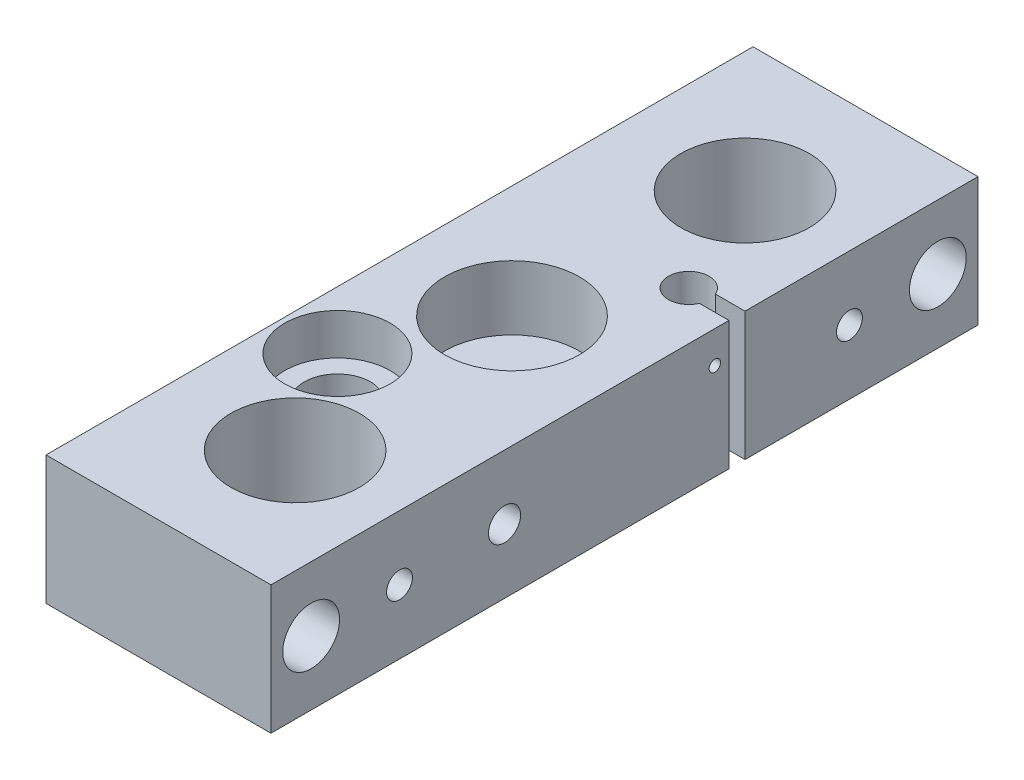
ISO-10303-21;
HEADER;
FILE_DESCRIPTION(('STEP AP214'),'2;1');
FILE_NAME('part.step','',(''),(''),'','','');
FILE_SCHEMA(('AUTOMOTIVE_DESIGN { 1 0 10303 214 1 1 1 1 }'));
ENDSEC;
DATA;
#1=APPLICATION_CONTEXT('core data for automotive mechanical design processes');
#2=APPLICATION_PROTOCOL_DEFINITION('international standard','automotive_design',2000,#1);
#3=PRODUCT_CONTEXT('',#1,'mechanical');
#4=PRODUCT('Part','Part','',(#3));
#5=PRODUCT_RELATED_PRODUCT_CATEGORY('part','',(#4));
#6=PRODUCT_DEFINITION_FORMATION('','',#4);
#7=PRODUCT_DEFINITION_CONTEXT('part definition',#1,'design');
#8=PRODUCT_DEFINITION('design','',#6,#7);
#9=PRODUCT_DEFINITION_SHAPE('','',#8);
#10=(LENGTH_UNIT() NAMED_UNIT(*) SI_UNIT(.MILLI.,.METRE.));
#11=(NAMED_UNIT(*) PLANE_ANGLE_UNIT() SI_UNIT($,.RADIAN.));
#12=(NAMED_UNIT(*) SI_UNIT($,.STERADIAN.) SOLID_ANGLE_UNIT());
#13=UNCERTAINTY_MEASURE_WITH_UNIT(LENGTH_MEASURE(1.E-05),#10,'distance_accuracy_value','');
#14=(GEOMETRIC_REPRESENTATION_CONTEXT(3) GLOBAL_UNCERTAINTY_ASSIGNED_CONTEXT((#13)) GLOBAL_UNIT_ASSIGNED_CONTEXT((#10,
#11,#12)) REPRESENTATION_CONTEXT('',''));
#15=CARTESIAN_POINT('',(0.,0.,0.));
#16=DIRECTION('',(0.,0.,1.));
#17=DIRECTION('',(1.,0.,0.));
#18=AXIS2_PLACEMENT_3D('',#15,#16,#17);
#19=CARTESIAN_POINT('',(22.225,12.7,-69.85));
#20=DIRECTION('',(-1.,0.,0.));
#21=DIRECTION('',(0.,0.,1.));
#22=AXIS2_PLACEMENT_3D('',#19,#20,#21);
#23=PLANE('',#22);
#24=CARTESIAN_POINT('',(22.225,0.,-44.45));
#25=DIRECTION('',(1.,0.,0.));
#26=DIRECTION('',(0.,0.,-1.));
#27=AXIS2_PLACEMENT_3D('',#24,#25,#26);
#28=CIRCLE('',#27,2.55269999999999);
#29=CARTESIAN_POINT('',(22.225,0.,-47.0027));
#30=VERTEX_POINT('',#29);
#31=EDGE_CURVE('E226',#30,#30,#28,.T.);
#32=ORIENTED_EDGE('',*,*,#31,.F.);
#33=EDGE_LOOP('',(#32));
#34=FACE_BOUND('',#33,.T.);
#35=CARTESIAN_POINT('',(22.225,0.,-61.9125));
#36=DIRECTION('',(1.,0.,0.));
#37=DIRECTION('',(0.,0.,-1.));
#38=AXIS2_PLACEMENT_3D('',#35,#36,#37);
#39=CIRCLE('',#38,5.61339999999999);
#40=CARTESIAN_POINT('',(22.225,0.,-67.5259));
#41=VERTEX_POINT('',#40);
#42=EDGE_CURVE('E201',#41,#41,#39,.T.);
#43=ORIENTED_EDGE('',*,*,#42,.F.);
#44=EDGE_LOOP('',(#43));
#45=FACE_BOUND('',#44,.T.);
#46=DIRECTION('',(0.,0.,-1.));
#47=VECTOR('',#46,1.);
#48=CARTESIAN_POINT('',(22.225,12.7,-69.85));
#49=LINE('',#48,#47);
#50=CARTESIAN_POINT('',(22.225,12.7,-23.8125));
#51=VERTEX_POINT('',#50);
#52=CARTESIAN_POINT('',(22.225,12.7,-69.85));
#53=VERTEX_POINT('',#52);
#54=EDGE_CURVE('E396',#51,#53,#49,.T.);
#55=ORIENTED_EDGE('',*,*,#54,.F.);
#56=DIRECTION('',(0.,1.,0.));
#57=VECTOR('',#56,1.);
#58=CARTESIAN_POINT('',(22.225,-12.7,-23.8125));
#59=LINE('',#58,#57);
#60=CARTESIAN_POINT('',(22.225,-12.7,-23.8125));
#61=VERTEX_POINT('',#60);
#62=EDGE_CURVE('E155',#61,#51,#59,.T.);
#63=ORIENTED_EDGE('',*,*,#62,.F.);
#64=DIRECTION('',(0.,0.,-1.));
#65=VECTOR('',#64,1.);
#66=CARTESIAN_POINT('',(22.225,-12.7,-69.85));
#67=LINE('',#66,#65);
#68=CARTESIAN_POINT('',(22.225,-12.7,-69.85));
#69=VERTEX_POINT('',#68);
#70=EDGE_CURVE('E350',#61,#69,#67,.T.);
#71=ORIENTED_EDGE('',*,*,#70,.T.);
#72=DIRECTION('',(0.,-1.,0.));
#73=VECTOR('',#72,1.);
#74=CARTESIAN_POINT('',(22.225,12.7,-69.85));
#75=LINE('',#74,#73);
#76=EDGE_CURVE('E360',#53,#69,#75,.T.);
#77=ORIENTED_EDGE('',*,*,#76,.F.);
#78=EDGE_LOOP('',(#55,#63,#71,#77));
#79=FACE_BOUND('',#78,.T.);
#80=ADVANCED_FACE('F37',(#34,#45,#79),#23,.F.);
#81=CARTESIAN_POINT('',(-22.225,12.7,-69.85));
#82=DIRECTION('',(1.,0.,0.));
#83=DIRECTION('',(0.,0.,-1.));
#84=AXIS2_PLACEMENT_3D('',#81,#82,#83);
#85=PLANE('',#84);
#86=CARTESIAN_POINT('',(-22.225,0.,-61.9125));
#87=DIRECTION('',(1.,0.,0.));
#88=DIRECTION('',(0.,0.,-1.));
#89=AXIS2_PLACEMENT_3D('',#86,#87,#88);
#90=CIRCLE('',#89,4.21639999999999);
#91=CARTESIAN_POINT('',(-22.225,0.,-66.1289));
#92=VERTEX_POINT('',#91);
#93=EDGE_CURVE('E190',#92,#92,#90,.T.);
#94=ORIENTED_EDGE('',*,*,#93,.T.);
#95=EDGE_LOOP('',(#94));
#96=FACE_BOUND('',#95,.T.);
#97=CARTESIAN_POINT('',(-22.225,0.,61.9125));
#98=DIRECTION('',(1.,0.,0.));
#99=DIRECTION('',(0.,0.,-1.));
#100=AXIS2_PLACEMENT_3D('',#97,#98,#99);
#101=CIRCLE('',#100,4.21639999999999);
#102=CARTESIAN_POINT('',(-22.225,0.,57.6961));
#103=VERTEX_POINT('',#102);
#104=EDGE_CURVE('E204',#103,#103,#101,.T.);
#105=ORIENTED_EDGE('',*,*,#104,.T.);
#106=EDGE_LOOP('',(#105));
#107=FACE_BOUND('',#106,.T.);
#108=DIRECTION('',(0.,0.,1.));
#109=VECTOR('',#108,1.);
#110=CARTESIAN_POINT('',(-22.225,-12.7,-69.85));
#111=LINE('',#110,#109);
#112=CARTESIAN_POINT('',(-22.225,-12.7,-69.85));
#113=VERTEX_POINT('',#112);
#114=CARTESIAN_POINT('',(-22.225,-12.7,69.85));
#115=VERTEX_POINT('',#114);
#116=EDGE_CURVE('E388',#113,#115,#111,.T.);
#117=ORIENTED_EDGE('',*,*,#116,.T.);
#118=DIRECTION('',(0.,-1.,0.));
#119=VECTOR('',#118,1.);
#120=CARTESIAN_POINT('',(-22.225,12.7,69.85));
#121=LINE('',#120,#119);
#122=CARTESIAN_POINT('',(-22.225,12.7,69.85));
#123=VERTEX_POINT('',#122);
#124=EDGE_CURVE('E11',#123,#115,#121,.T.);
#125=ORIENTED_EDGE('',*,*,#124,.F.);
#126=DIRECTION('',(0.,0.,1.));
#127=VECTOR('',#126,1.);
#128=CARTESIAN_POINT('',(-22.225,12.7,-69.85));
#129=LINE('',#128,#127);
#130=CARTESIAN_POINT('',(-22.225,12.7,-69.85));
#131=VERTEX_POINT('',#130);
#132=EDGE_CURVE('E352',#131,#123,#129,.T.);
#133=ORIENTED_EDGE('',*,*,#132,.F.);
#134=DIRECTION('',(0.,-1.,0.));
#135=VECTOR('',#134,1.);
#136=CARTESIAN_POINT('',(-22.225,12.7,-69.85));
#137=LINE('',#136,#135);
#138=EDGE_CURVE('E358',#131,#113,#137,.T.);
#139=ORIENTED_EDGE('',*,*,#138,.T.);
#140=EDGE_LOOP('',(#117,#125,#133,#139));
#141=FACE_BOUND('',#140,.T.);
#142=ADVANCED_FACE('F39',(#96,#107,#141),#85,.F.);
#143=CARTESIAN_POINT('',(-22.225,12.7,69.85));
#144=DIRECTION('',(0.,0.,-1.));
#145=DIRECTION('',(-1.,0.,0.));
#146=AXIS2_PLACEMENT_3D('',#143,#144,#145);
#147=PLANE('',#146);
#148=DIRECTION('',(1.,0.,0.));
#149=VECTOR('',#148,1.);
#150=CARTESIAN_POINT('',(-22.225,-12.7,69.85));
#151=LINE('',#150,#149);
#152=CARTESIAN_POINT('',(22.225,-12.7,69.85));
#153=VERTEX_POINT('',#152);
#154=EDGE_CURVE('E354',#115,#153,#151,.T.);
#155=ORIENTED_EDGE('',*,*,#154,.T.);
#156=DIRECTION('',(0.,-1.,0.));
#157=VECTOR('',#156,1.);
#158=CARTESIAN_POINT('',(22.225,12.7,69.85));
#159=LINE('',#158,#157);
#160=CARTESIAN_POINT('',(22.225,12.7,69.85));
#161=VERTEX_POINT('',#160);
#162=EDGE_CURVE('E50',#161,#153,#159,.T.);
#163=ORIENTED_EDGE('',*,*,#162,.F.);
#164=DIRECTION('',(1.,0.,0.));
#165=VECTOR('',#164,1.);
#166=CARTESIAN_POINT('',(-22.225,12.7,69.85));
#167=LINE('',#166,#165);
#168=EDGE_CURVE('E95',#123,#161,#167,.T.);
#169=ORIENTED_EDGE('',*,*,#168,.F.);
#170=ORIENTED_EDGE('',*,*,#124,.T.);
#171=EDGE_LOOP('',(#155,#163,#169,#170));
#172=FACE_BOUND('',#171,.T.);
#173=ADVANCED_FACE('F338',(#172),#147,.F.);
#174=CARTESIAN_POINT('',(22.225,0.,23.6982));
#175=DIRECTION('',(1.,0.,0.));
#176=DIRECTION('',(0.,0.,-1.));
#177=AXIS2_PLACEMENT_3D('',#174,#175,#176);
#178=CIRCLE('',#177,3.175);
#179=CARTESIAN_POINT('',(22.225,0.,20.5232));
#180=VERTEX_POINT('',#179);
#181=EDGE_CURVE('E146',#180,#180,#178,.T.);
#182=ORIENTED_EDGE('',*,*,#181,.F.);
#183=EDGE_LOOP('',(#182));
#184=FACE_BOUND('',#183,.T.);
#185=CARTESIAN_POINT('',(22.225,6.35,-17.8562));
#186=DIRECTION('',(1.,0.,0.));
#187=DIRECTION('',(0.,0.,-1.));
#188=AXIS2_PLACEMENT_3D('',#185,#186,#187);
#189=CIRCLE('',#188,1.13029999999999);
#190=CARTESIAN_POINT('',(22.225,6.35,-18.9865));
#191=VERTEX_POINT('',#190);
#192=EDGE_CURVE('E161',#191,#191,#189,.T.);
#193=ORIENTED_EDGE('',*,*,#192,.F.);
#194=EDGE_LOOP('',(#193));
#195=FACE_BOUND('',#194,.T.);
#196=CARTESIAN_POINT('',(22.225,0.,61.9125));
#197=DIRECTION('',(1.,0.,0.));
#198=DIRECTION('',(0.,0.,-1.));
#199=AXIS2_PLACEMENT_3D('',#196,#197,#198);
#200=CIRCLE('',#199,5.61339999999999);
#201=CARTESIAN_POINT('',(22.225,0.,56.2991));
#202=VERTEX_POINT('',#201);
#203=EDGE_CURVE('E213',#202,#202,#200,.T.);
#204=ORIENTED_EDGE('',*,*,#203,.F.);
#205=EDGE_LOOP('',(#204));
#206=FACE_BOUND('',#205,.T.);
#207=CARTESIAN_POINT('',(22.225,0.,44.45));
#208=DIRECTION('',(1.,0.,0.));
#209=DIRECTION('',(0.,0.,-1.));
#210=AXIS2_PLACEMENT_3D('',#207,#208,#209);
#211=CIRCLE('',#210,2.55269999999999);
#212=CARTESIAN_POINT('',(22.225,0.,41.8973));
#213=VERTEX_POINT('',#212);
#214=EDGE_CURVE('E216',#213,#213,#211,.T.);
#215=ORIENTED_EDGE('',*,*,#214,.F.);
#216=EDGE_LOOP('',(#215));
#217=FACE_BOUND('',#216,.T.);
#218=CARTESIAN_POINT('',(22.225,-12.7,-20.6375));
#219=VERTEX_POINT('',#218);
#220=EDGE_CURVE('E347',#153,#219,#67,.T.);
#221=ORIENTED_EDGE('',*,*,#220,.T.);
#222=DIRECTION('',(0.,1.,0.));
#223=VECTOR('',#222,1.);
#224=CARTESIAN_POINT('',(22.225,-12.7,-20.6375));
#225=LINE('',#224,#223);
#226=CARTESIAN_POINT('',(22.225,12.7,-20.6375));
#227=VERTEX_POINT('',#226);
#228=EDGE_CURVE('E58',#219,#227,#225,.T.);
#229=ORIENTED_EDGE('',*,*,#228,.T.);
#230=EDGE_CURVE('E397',#161,#227,#49,.T.);
#231=ORIENTED_EDGE('',*,*,#230,.F.);
#232=ORIENTED_EDGE('',*,*,#162,.T.);
#233=EDGE_LOOP('',(#221,#229,#231,#232));
#234=FACE_BOUND('',#233,.T.);
#235=ADVANCED_FACE('F334',(#184,#195,#206,#217,#234),#23,.F.);
#236=CARTESIAN_POINT('',(-22.225,12.7,-69.85));
#237=DIRECTION('',(0.,0.,1.));
#238=DIRECTION('',(1.,0.,0.));
#239=AXIS2_PLACEMENT_3D('',#236,#237,#238);
#240=PLANE('',#239);
#241=DIRECTION('',(-1.,0.,0.));
#242=VECTOR('',#241,1.);
#243=CARTESIAN_POINT('',(-22.225,-12.7,-69.85));
#244=LINE('',#243,#242);
#245=EDGE_CURVE('E88',#69,#113,#244,.T.);
#246=ORIENTED_EDGE('',*,*,#245,.T.);
#247=ORIENTED_EDGE('',*,*,#138,.F.);
#248=DIRECTION('',(-1.,0.,0.));
#249=VECTOR('',#248,1.);
#250=CARTESIAN_POINT('',(-22.225,12.7,-69.85));
#251=LINE('',#250,#249);
#252=EDGE_CURVE('E67',#53,#131,#251,.T.);
#253=ORIENTED_EDGE('',*,*,#252,.F.);
#254=ORIENTED_EDGE('',*,*,#76,.T.);
#255=EDGE_LOOP('',(#246,#247,#253,#254));
#256=FACE_BOUND('',#255,.T.);
#257=ADVANCED_FACE('F337',(#256),#240,.F.);
#258=CARTESIAN_POINT('',(-22.225,12.7,69.85));
#259=DIRECTION('',(0.,1.,0.));
#260=DIRECTION('',(0.,0.,1.));
#261=AXIS2_PLACEMENT_3D('',#258,#259,#260);
#262=PLANE('',#261);
#263=DIRECTION('',(-1.,0.,0.));
#264=VECTOR('',#263,1.);
#265=CARTESIAN_POINT('',(22.225,12.7,-23.8125));
#266=LINE('',#265,#264);
#267=CARTESIAN_POINT('',(16.3858673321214,12.7,-23.8125));
#268=VERTEX_POINT('',#267);
#269=EDGE_CURVE('E140',#51,#268,#266,.T.);
#270=ORIENTED_EDGE('',*,*,#269,.F.);
#271=ORIENTED_EDGE('',*,*,#54,.T.);
#272=ORIENTED_EDGE('',*,*,#252,.T.);
#273=ORIENTED_EDGE('',*,*,#132,.T.);
#274=ORIENTED_EDGE('',*,*,#168,.T.);
#275=ORIENTED_EDGE('',*,*,#230,.T.);
#276=DIRECTION('',(1.,0.,0.));
#277=VECTOR('',#276,1.);
#278=CARTESIAN_POINT('',(22.225,12.7,-20.6375));
#279=LINE('',#278,#277);
#280=CARTESIAN_POINT('',(16.3858673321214,12.7,-20.6375));
#281=VERTEX_POINT('',#280);
#282=EDGE_CURVE('E143',#281,#227,#279,.T.);
#283=ORIENTED_EDGE('',*,*,#282,.F.);
#284=CARTESIAN_POINT('',(12.7,12.7,-22.225));
#285=DIRECTION('',(0.,1.,0.));
#286=DIRECTION('',(0.,0.,1.));
#287=AXIS2_PLACEMENT_3D('',#284,#285,#286);
#288=CIRCLE('',#287,4.0132);
#289=EDGE_CURVE('E128',#268,#281,#288,.T.);
#290=ORIENTED_EDGE('',*,*,#289,.F.);
#291=EDGE_LOOP('',(#270,#271,#272,#273,#274,#275,#283,#290));
#292=FACE_BOUND('',#291,.T.);
#293=CARTESIAN_POINT('',(0.,12.7,0.));
#294=DIRECTION('',(0.,1.,0.));
#295=DIRECTION('',(0.,0.,1.));
#296=AXIS2_PLACEMENT_3D('',#293,#294,#295);
#297=CIRCLE('',#296,13.335);
#298=CARTESIAN_POINT('',(0.,12.7,13.335));
#299=VERTEX_POINT('',#298);
#300=EDGE_CURVE('E178',#299,#299,#297,.T.);
#301=ORIENTED_EDGE('',*,*,#300,.F.);
#302=EDGE_LOOP('',(#301));
#303=FACE_BOUND('',#302,.T.);
#304=CARTESIAN_POINT('',(-10.795,12.7,23.6982));
#305=DIRECTION('',(0.,1.,0.));
#306=DIRECTION('',(0.,0.,1.));
#307=AXIS2_PLACEMENT_3D('',#304,#305,#306);
#308=CIRCLE('',#307,10.414);
#309=CARTESIAN_POINT('',(-10.795,12.7,34.1122));
#310=VERTEX_POINT('',#309);
#311=EDGE_CURVE('E186',#310,#310,#308,.T.);
#312=ORIENTED_EDGE('',*,*,#311,.F.);
#313=EDGE_LOOP('',(#312));
#314=FACE_BOUND('',#313,.T.);
#315=CARTESIAN_POINT('',(1.6002,12.7,-44.45));
#316=DIRECTION('',(0.,1.,0.));
#317=DIRECTION('',(0.,0.,-1.));
#318=AXIS2_PLACEMENT_3D('',#315,#316,#317);
#319=CIRCLE('',#318,12.7);
#320=CARTESIAN_POINT('',(1.6002,12.7,-57.15));
#321=VERTEX_POINT('',#320);
#322=EDGE_CURVE('E379',#321,#321,#319,.T.);
#323=ORIENTED_EDGE('',*,*,#322,.F.);
#324=EDGE_LOOP('',(#323));
#325=FACE_BOUND('',#324,.T.);
#326=CARTESIAN_POINT('',(1.6002,12.7,44.45));
#327=DIRECTION('',(0.,1.,0.));
#328=DIRECTION('',(0.,0.,1.));
#329=AXIS2_PLACEMENT_3D('',#326,#327,#328);
#330=CIRCLE('',#329,12.7);
#331=CARTESIAN_POINT('',(1.6002,12.7,57.15));
#332=VERTEX_POINT('',#331);
#333=EDGE_CURVE('E382',#332,#332,#330,.T.);
#334=ORIENTED_EDGE('',*,*,#333,.F.);
#335=EDGE_LOOP('',(#334));
#336=FACE_BOUND('',#335,.T.);
#337=ADVANCED_FACE('F370',(#292,#303,#314,#325,#336),#262,.T.);
#338=CARTESIAN_POINT('',(-22.225,-12.7,69.85));
#339=DIRECTION('',(0.,1.,0.));
#340=DIRECTION('',(0.,0.,1.));
#341=AXIS2_PLACEMENT_3D('',#338,#339,#340);
#342=PLANE('',#341);
#343=CARTESIAN_POINT('',(0.,-12.7,0.));
#344=DIRECTION('',(0.,-1.,0.));
#345=DIRECTION('',(0.,0.,-1.));
#346=AXIS2_PLACEMENT_3D('',#343,#344,#345);
#347=CIRCLE('',#346,4.74472);
#348=CARTESIAN_POINT('',(0.,-12.7,-4.74472));
#349=VERTEX_POINT('',#348);
#350=EDGE_CURVE('E170',#349,#349,#347,.T.);
#351=ORIENTED_EDGE('',*,*,#350,.F.);
#352=EDGE_LOOP('',(#351));
#353=FACE_BOUND('',#352,.T.);
#354=CARTESIAN_POINT('',(-10.795,-12.7,23.6982));
#355=DIRECTION('',(0.,1.,0.));
#356=DIRECTION('',(0.,0.,1.));
#357=AXIS2_PLACEMENT_3D('',#354,#355,#356);
#358=CIRCLE('',#357,6.54811999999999);
#359=CARTESIAN_POINT('',(-10.795,-12.7,30.24632));
#360=VERTEX_POINT('',#359);
#361=EDGE_CURVE('E177',#360,#360,#358,.T.);
#362=ORIENTED_EDGE('',*,*,#361,.T.);
#363=EDGE_LOOP('',(#362));
#364=FACE_BOUND('',#363,.T.);
#365=CARTESIAN_POINT('',(1.6002,-12.7,-44.45));
#366=DIRECTION('',(0.,1.,0.));
#367=DIRECTION('',(0.,0.,-1.));
#368=AXIS2_PLACEMENT_3D('',#365,#366,#367);
#369=CIRCLE('',#368,12.7);
#370=CARTESIAN_POINT('',(1.6002,-12.7,-57.15));
#371=VERTEX_POINT('',#370);
#372=EDGE_CURVE('E385',#371,#371,#369,.T.);
#373=ORIENTED_EDGE('',*,*,#372,.T.);
#374=EDGE_LOOP('',(#373));
#375=FACE_BOUND('',#374,.T.);
#376=CARTESIAN_POINT('',(1.6002,-12.7,44.45));
#377=DIRECTION('',(0.,1.,0.));
#378=DIRECTION('',(0.,0.,1.));
#379=AXIS2_PLACEMENT_3D('',#376,#377,#378);
#380=CIRCLE('',#379,12.7);
#381=CARTESIAN_POINT('',(1.6002,-12.7,57.15));
#382=VERTEX_POINT('',#381);
#383=EDGE_CURVE('E384',#382,#382,#380,.T.);
#384=ORIENTED_EDGE('',*,*,#383,.T.);
#385=EDGE_LOOP('',(#384));
#386=FACE_BOUND('',#385,.T.);
#387=ORIENTED_EDGE('',*,*,#70,.F.);
#388=DIRECTION('',(-1.,0.,0.));
#389=VECTOR('',#388,1.);
#390=CARTESIAN_POINT('',(22.225,-12.7,-23.8125));
#391=LINE('',#390,#389);
#392=CARTESIAN_POINT('',(16.3858673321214,-12.7,-23.8125));
#393=VERTEX_POINT('',#392);
#394=EDGE_CURVE('E130',#61,#393,#391,.T.);
#395=ORIENTED_EDGE('',*,*,#394,.T.);
#396=CARTESIAN_POINT('',(12.7,-12.7,-22.225));
#397=DIRECTION('',(0.,1.,0.));
#398=DIRECTION('',(0.,0.,1.));
#399=AXIS2_PLACEMENT_3D('',#396,#397,#398);
#400=CIRCLE('',#399,4.0132);
#401=CARTESIAN_POINT('',(16.3858673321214,-12.7,-20.6375));
#402=VERTEX_POINT('',#401);
#403=EDGE_CURVE('E125',#393,#402,#400,.T.);
#404=ORIENTED_EDGE('',*,*,#403,.T.);
#405=DIRECTION('',(1.,0.,0.));
#406=VECTOR('',#405,1.);
#407=CARTESIAN_POINT('',(22.225,-12.7,-20.6375));
#408=LINE('',#407,#406);
#409=EDGE_CURVE('E132',#402,#219,#408,.T.);
#410=ORIENTED_EDGE('',*,*,#409,.T.);
#411=ORIENTED_EDGE('',*,*,#220,.F.);
#412=ORIENTED_EDGE('',*,*,#154,.F.);
#413=ORIENTED_EDGE('',*,*,#116,.F.);
#414=ORIENTED_EDGE('',*,*,#245,.F.);
#415=EDGE_LOOP('',(#387,#395,#404,#410,#411,#412,#413,#414));
#416=FACE_BOUND('',#415,.T.);
#417=ADVANCED_FACE('F139',(#353,#364,#375,#386,#416),#342,.F.);
#418=CARTESIAN_POINT('',(1.6002,-12.7,44.45));
#419=DIRECTION('',(0.,1.,0.));
#420=DIRECTION('',(0.,0.,1.));
#421=AXIS2_PLACEMENT_3D('',#418,#419,#420);
#422=CYLINDRICAL_SURFACE('',#421,12.7);
#423=CARTESIAN_POINT('',(14.0410087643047,0.,41.8973));
#424=CARTESIAN_POINT('',(14.0410115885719,0.141823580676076,41.8973052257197));
#425=CARTESIAN_POINT('',(14.0434602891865,0.283712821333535,41.9091593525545));
#426=CARTESIAN_POINT('',(14.0529759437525,0.563476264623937,41.9562225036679));
#427=CARTESIAN_POINT('',(14.060046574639,0.701347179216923,41.9914501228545));
#428=CARTESIAN_POINT('',(14.077973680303,0.968986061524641,42.0841228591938));
#429=CARTESIAN_POINT('',(14.0888263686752,1.09876198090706,42.1415457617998));
#430=CARTESIAN_POINT('',(14.1130902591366,1.34683464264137,42.2769180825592));
#431=CARTESIAN_POINT('',(14.1265013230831,1.4651320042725,42.3548663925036));
#432=CARTESIAN_POINT('',(14.1545848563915,1.68858499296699,42.5302635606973));
#433=CARTESIAN_POINT('',(14.1692712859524,1.79355282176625,42.6279494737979));
#434=CARTESIAN_POINT('',(14.1981279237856,1.98572731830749,42.8395367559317));
#435=CARTESIAN_POINT('',(14.2122980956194,2.07293273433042,42.9534392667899));
#436=CARTESIAN_POINT('',(14.2386762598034,2.22783640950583,43.1954708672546));
#437=CARTESIAN_POINT('',(14.2508658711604,2.29535609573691,43.3237164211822));
#438=CARTESIAN_POINT('',(14.2717526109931,2.40781921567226,43.590017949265));
#439=CARTESIAN_POINT('',(14.2804500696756,2.45276478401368,43.7280729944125));
#440=CARTESIAN_POINT('',(14.29327390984,2.518218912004,44.0081254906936));
#441=CARTESIAN_POINT('',(14.2974595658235,2.53904462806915,44.1500460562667));
#442=CARTESIAN_POINT('',(14.3009929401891,2.55665750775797,44.4354242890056));
#443=CARTESIAN_POINT('',(14.3003411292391,2.55344701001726,44.5788818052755));
#444=CARTESIAN_POINT('',(14.2943189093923,2.52331892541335,44.8610819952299));
#445=CARTESIAN_POINT('',(14.2890165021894,2.49674297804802,44.9998628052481));
#446=CARTESIAN_POINT('',(14.2743656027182,2.42118040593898,45.2709540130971));
#447=CARTESIAN_POINT('',(14.2650169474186,2.37219287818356,45.4032641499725));
#448=CARTESIAN_POINT('',(14.2432120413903,2.25288195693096,45.6586314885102));
#449=CARTESIAN_POINT('',(14.230736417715,2.18242494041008,45.7816245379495));
#450=CARTESIAN_POINT('',(14.2040524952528,2.02227397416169,46.0141683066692));
#451=CARTESIAN_POINT('',(14.1898439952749,1.93257778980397,46.1237174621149));
#452=CARTESIAN_POINT('',(14.1609682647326,1.73462116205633,46.3282914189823));
#453=CARTESIAN_POINT('',(14.146297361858,1.62606172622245,46.4230266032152));
#454=CARTESIAN_POINT('',(14.1183874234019,1.39444832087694,46.5929943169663));
#455=CARTESIAN_POINT('',(14.1051484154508,1.27139407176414,46.6682264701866));
#456=CARTESIAN_POINT('',(14.0815938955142,1.0138654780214,46.7971539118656));
#457=CARTESIAN_POINT('',(14.0712848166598,0.879366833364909,46.8508019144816));
#458=CARTESIAN_POINT('',(14.0548514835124,0.603009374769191,46.9346530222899));
#459=CARTESIAN_POINT('',(14.0487266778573,0.461151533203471,46.9648592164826));
#460=CARTESIAN_POINT('',(14.0414659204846,0.176728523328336,47.0005355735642));
#461=CARTESIAN_POINT('',(14.0402455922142,0.0342179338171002,47.0064241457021));
#462=CARTESIAN_POINT('',(14.0427054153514,-0.249749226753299,46.9944243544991));
#463=CARTESIAN_POINT('',(14.0463852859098,-0.391205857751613,46.9765373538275));
#464=CARTESIAN_POINT('',(14.0581518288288,-0.667640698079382,46.9178549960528));
#465=CARTESIAN_POINT('',(14.0661954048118,-0.802668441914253,46.8772835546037));
#466=CARTESIAN_POINT('',(14.0857452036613,-1.06400985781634,46.7746235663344));
#467=CARTESIAN_POINT('',(14.0972517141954,-1.19032280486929,46.7125332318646));
#468=CARTESIAN_POINT('',(14.122620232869,-1.43247888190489,46.5676521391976));
#469=CARTESIAN_POINT('',(14.1365112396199,-1.54816240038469,46.4845997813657));
#470=CARTESIAN_POINT('',(14.1650041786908,-1.76410334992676,46.3005005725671));
#471=CARTESIAN_POINT('',(14.1796061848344,-1.86435917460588,46.1994518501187));
#472=CARTESIAN_POINT('',(14.208149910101,-2.04818715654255,45.9803492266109));
#473=CARTESIAN_POINT('',(14.2220778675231,-2.13147629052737,45.8620557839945));
#474=CARTESIAN_POINT('',(14.2474641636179,-2.27699829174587,45.6129123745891));
#475=CARTESIAN_POINT('',(14.2589226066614,-2.33923204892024,45.4820629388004));
#476=CARTESIAN_POINT('',(14.278020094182,-2.4404651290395,45.212262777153));
#477=CARTESIAN_POINT('',(14.2856808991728,-2.47959707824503,45.0733634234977));
#478=CARTESIAN_POINT('',(14.2964133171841,-2.53393565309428,44.7907935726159));
#479=CARTESIAN_POINT('',(14.2994854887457,-2.54914519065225,44.6471236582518));
#480=CARTESIAN_POINT('',(14.3006811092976,-2.55509349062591,44.3617934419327));
#481=CARTESIAN_POINT('',(14.2988905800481,-2.54625761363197,44.2201421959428));
#482=CARTESIAN_POINT('',(14.29074302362,-2.50530572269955,43.9403870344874));
#483=CARTESIAN_POINT('',(14.2843860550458,-2.47319000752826,43.8022830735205));
#484=CARTESIAN_POINT('',(14.2678225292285,-2.38677992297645,43.5338110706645));
#485=CARTESIAN_POINT('',(14.2576249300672,-2.33253713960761,43.4034258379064));
#486=CARTESIAN_POINT('',(14.2344776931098,-2.20346668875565,43.1535465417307));
#487=CARTESIAN_POINT('',(14.2215278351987,-2.12863737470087,43.0340533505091));
#488=CARTESIAN_POINT('',(14.1940336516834,-1.9590856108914,42.8072483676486));
#489=CARTESIAN_POINT('',(14.1794667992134,-1.8640591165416,42.7001665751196));
#490=CARTESIAN_POINT('',(14.1505135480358,-1.65743454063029,42.5033226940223));
#491=CARTESIAN_POINT('',(14.1361271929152,-1.54583253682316,42.4135647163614));
#492=CARTESIAN_POINT('',(14.1089910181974,-1.30776531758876,42.2529862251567));
#493=CARTESIAN_POINT('',(14.0962607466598,-1.18115134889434,42.1823828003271));
#494=CARTESIAN_POINT('',(14.0741172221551,-0.917636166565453,42.0635651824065));
#495=CARTESIAN_POINT('',(14.0647009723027,-0.780744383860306,42.0153307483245));
#496=CARTESIAN_POINT('',(14.0521241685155,-0.536292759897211,41.9519356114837));
#497=CARTESIAN_POINT('',(14.047981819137,-0.43012382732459,41.9314840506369));
#498=CARTESIAN_POINT('',(14.0424230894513,-0.215982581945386,41.9041644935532));
#499=CARTESIAN_POINT('',(14.0410066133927,-0.108010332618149,41.8972960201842));
#500=CARTESIAN_POINT('',(14.0410087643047,0.,41.8973));
#501=B_SPLINE_CURVE_WITH_KNOTS('',3,(#423,#424,#425,#426,#427,#428,#429,#430,#431,#432,#433,
#434,#435,#436,#437,#438,#439,#440,#441,#442,#443,#444,#445,#446,#447,#448,#449,#450,#451,#452,
#453,#454,#455,#456,#457,#458,#459,#460,#461,#462,#463,#464,#465,#466,#467,#468,#469,#470,#471,
#472,#473,#474,#475,#476,#477,#478,#479,#480,#481,#482,#483,#484,#485,#486,#487,#488,#489,#490,
#491,#492,#493,#494,#495,#496,#497,#498,#499,#500),.UNSPECIFIED.,.T.,.F.,(4,2,2,2,2,2,2,2,2,2,2,
2,2,2,2,2,2,2,2,2,2,2,2,2,2,2,2,2,2,2,2,2,2,2,2,2,2,2,4),(0.,0.425075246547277,
0.850489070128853,1.27547820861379,1.70044440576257,2.13085548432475,2.56129688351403,
2.9955293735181,3.42972079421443,3.85813570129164,4.28650892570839,4.70872092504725,
5.13094993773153,5.55586246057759,5.98082436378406,6.41326685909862,6.84571769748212,
7.27911084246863,7.71244686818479,8.13829502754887,8.56411878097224,8.98581164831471,
9.40753955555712,9.83481596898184,10.2621368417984,10.6960885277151,11.1300218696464,
11.5614391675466,11.9928039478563,12.4165877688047,12.8403661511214,13.2631621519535,
13.6859919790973,14.1157058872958,14.5455216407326,14.9800225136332,15.4141294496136,
15.7378706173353,16.061600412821),.UNSPECIFIED.);
#502=CARTESIAN_POINT('',(14.0410087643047,0.,41.8973));
#503=VERTEX_POINT('',#502);
#504=EDGE_CURVE('E219',#503,#503,#501,.T.);
#505=ORIENTED_EDGE('',*,*,#504,.T.);
#506=EDGE_LOOP('',(#505));
#507=FACE_BOUND('',#506,.T.);
#508=ORIENTED_EDGE('',*,*,#383,.F.);
#509=EDGE_LOOP('',(#508));
#510=FACE_BOUND('',#509,.T.);
#511=ORIENTED_EDGE('',*,*,#333,.T.);
#512=EDGE_LOOP('',(#511));
#513=FACE_BOUND('',#512,.T.);
#514=ADVANCED_FACE('F438',(#507,#510,#513),#422,.F.);
#515=CARTESIAN_POINT('',(1.6002,-12.7,-44.45));
#516=DIRECTION('',(0.,1.,0.));
#517=DIRECTION('',(0.,0.,1.));
#518=AXIS2_PLACEMENT_3D('',#515,#516,#517);
#519=CYLINDRICAL_SURFACE('',#518,12.7);
#520=CARTESIAN_POINT('',(14.0410087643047,0.,-47.0027));
#521=CARTESIAN_POINT('',(14.0410115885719,0.141823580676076,-47.0026947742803));
#522=CARTESIAN_POINT('',(14.0434602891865,0.283712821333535,-46.9908406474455));
#523=CARTESIAN_POINT('',(14.0529759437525,0.563476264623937,-46.9437774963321));
#524=CARTESIAN_POINT('',(14.060046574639,0.701347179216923,-46.9085498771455));
#525=CARTESIAN_POINT('',(14.077973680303,0.968986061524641,-46.8158771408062));
#526=CARTESIAN_POINT('',(14.0888263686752,1.09876198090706,-46.7584542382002));
#527=CARTESIAN_POINT('',(14.1130902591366,1.34683464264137,-46.6230819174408));
#528=CARTESIAN_POINT('',(14.1265013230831,1.4651320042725,-46.5451336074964));
#529=CARTESIAN_POINT('',(14.1545848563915,1.68858499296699,-46.3697364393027));
#530=CARTESIAN_POINT('',(14.1692712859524,1.79355282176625,-46.2720505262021));
#531=CARTESIAN_POINT('',(14.1981279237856,1.98572731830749,-46.0604632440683));
#532=CARTESIAN_POINT('',(14.2122980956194,2.07293273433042,-45.9465607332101));
#533=CARTESIAN_POINT('',(14.2386762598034,2.22783640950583,-45.7045291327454));
#534=CARTESIAN_POINT('',(14.2508658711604,2.29535609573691,-45.5762835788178));
#535=CARTESIAN_POINT('',(14.2717526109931,2.40781921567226,-45.309982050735));
#536=CARTESIAN_POINT('',(14.2804500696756,2.45276478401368,-45.1719270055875));
#537=CARTESIAN_POINT('',(14.29327390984,2.518218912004,-44.8918745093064));
#538=CARTESIAN_POINT('',(14.2974595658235,2.53904462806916,-44.7499539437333));
#539=CARTESIAN_POINT('',(14.3009929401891,2.55665750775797,-44.4645757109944));
#540=CARTESIAN_POINT('',(14.3003411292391,2.55344701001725,-44.3211181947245));
#541=CARTESIAN_POINT('',(14.2943189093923,2.52331892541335,-44.03891800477));
#542=CARTESIAN_POINT('',(14.2890165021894,2.49674297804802,-43.9001371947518));
#543=CARTESIAN_POINT('',(14.2743656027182,2.42118040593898,-43.6290459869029));
#544=CARTESIAN_POINT('',(14.2650169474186,2.37219287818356,-43.4967358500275));
#545=CARTESIAN_POINT('',(14.2432120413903,2.25288195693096,-43.2413685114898));
#546=CARTESIAN_POINT('',(14.230736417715,2.18242494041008,-43.1183754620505));
#547=CARTESIAN_POINT('',(14.2040524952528,2.02227397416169,-42.8858316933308));
#548=CARTESIAN_POINT('',(14.1898439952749,1.93257778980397,-42.7762825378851));
#549=CARTESIAN_POINT('',(14.1609682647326,1.73462116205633,-42.5717085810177));
#550=CARTESIAN_POINT('',(14.146297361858,1.62606172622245,-42.4769733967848));
#551=CARTESIAN_POINT('',(14.1183874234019,1.39444832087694,-42.3070056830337));
#552=CARTESIAN_POINT('',(14.1051484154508,1.27139407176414,-42.2317735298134));
#553=CARTESIAN_POINT('',(14.0815938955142,1.0138654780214,-42.1028460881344));
#554=CARTESIAN_POINT('',(14.0712848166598,0.879366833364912,-42.0491980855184));
#555=CARTESIAN_POINT('',(14.0548514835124,0.603009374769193,-41.9653469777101));
#556=CARTESIAN_POINT('',(14.0487266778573,0.461151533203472,-41.9351407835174));
#557=CARTESIAN_POINT('',(14.0414659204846,0.176728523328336,-41.8994644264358));
#558=CARTESIAN_POINT('',(14.0402455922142,0.0342179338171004,-41.8935758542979));
#559=CARTESIAN_POINT('',(14.0427054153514,-0.249749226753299,-41.9055756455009));
#560=CARTESIAN_POINT('',(14.0463852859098,-0.391205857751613,-41.9234626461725));
#561=CARTESIAN_POINT('',(14.0581518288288,-0.667640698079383,-41.9821450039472));
#562=CARTESIAN_POINT('',(14.0661954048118,-0.802668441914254,-42.0227164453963));
#563=CARTESIAN_POINT('',(14.0857452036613,-1.06400985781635,-42.1253764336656));
#564=CARTESIAN_POINT('',(14.0972517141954,-1.19032280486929,-42.1874667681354));
#565=CARTESIAN_POINT('',(14.122620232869,-1.43247888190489,-42.3323478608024));
#566=CARTESIAN_POINT('',(14.1365112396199,-1.54816240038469,-42.4154002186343));
#567=CARTESIAN_POINT('',(14.1650041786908,-1.76410334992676,-42.5994994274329));
#568=CARTESIAN_POINT('',(14.1796061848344,-1.86435917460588,-42.7005481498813));
#569=CARTESIAN_POINT('',(14.208149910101,-2.04818715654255,-42.9196507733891));
#570=CARTESIAN_POINT('',(14.2220778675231,-2.13147629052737,-43.0379442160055));
#571=CARTESIAN_POINT('',(14.2474641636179,-2.27699829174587,-43.2870876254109));
#572=CARTESIAN_POINT('',(14.2589226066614,-2.33923204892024,-43.4179370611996));
#573=CARTESIAN_POINT('',(14.278020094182,-2.4404651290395,-43.687737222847));
#574=CARTESIAN_POINT('',(14.2856808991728,-2.47959707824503,-43.8266365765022));
#575=CARTESIAN_POINT('',(14.2964133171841,-2.53393565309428,-44.1092064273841));
#576=CARTESIAN_POINT('',(14.2994854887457,-2.54914519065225,-44.2528763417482));
#577=CARTESIAN_POINT('',(14.3006811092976,-2.55509349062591,-44.5382065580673));
#578=CARTESIAN_POINT('',(14.2988905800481,-2.54625761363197,-44.6798578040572));
#579=CARTESIAN_POINT('',(14.29074302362,-2.50530572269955,-44.9596129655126));
#580=CARTESIAN_POINT('',(14.2843860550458,-2.47319000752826,-45.0977169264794));
#581=CARTESIAN_POINT('',(14.2678225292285,-2.38677992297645,-45.3661889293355));
#582=CARTESIAN_POINT('',(14.2576249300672,-2.33253713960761,-45.4965741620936));
#583=CARTESIAN_POINT('',(14.2344776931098,-2.20346668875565,-45.7464534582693));
#584=CARTESIAN_POINT('',(14.2215278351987,-2.12863737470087,-45.8659466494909));
#585=CARTESIAN_POINT('',(14.1940336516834,-1.9590856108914,-46.0927516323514));
#586=CARTESIAN_POINT('',(14.1794667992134,-1.8640591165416,-46.1998334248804));
#587=CARTESIAN_POINT('',(14.1505135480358,-1.65743454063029,-46.3966773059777));
#588=CARTESIAN_POINT('',(14.1361271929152,-1.54583253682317,-46.4864352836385));
#589=CARTESIAN_POINT('',(14.1089910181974,-1.30776531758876,-46.6470137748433));
#590=CARTESIAN_POINT('',(14.0962607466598,-1.18115134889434,-46.7176171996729));
#591=CARTESIAN_POINT('',(14.0741172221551,-0.917636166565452,-46.8364348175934));
#592=CARTESIAN_POINT('',(14.0647009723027,-0.780744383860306,-46.8846692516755));
#593=CARTESIAN_POINT('',(14.0521241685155,-0.536292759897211,-46.9480643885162));
#594=CARTESIAN_POINT('',(14.047981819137,-0.43012382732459,-46.9685159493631));
#595=CARTESIAN_POINT('',(14.0424230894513,-0.215982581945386,-46.9958355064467));
#596=CARTESIAN_POINT('',(14.0410066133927,-0.108010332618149,-47.0027039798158));
#597=CARTESIAN_POINT('',(14.0410087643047,0.,-47.0027));
#598=B_SPLINE_CURVE_WITH_KNOTS('',3,(#520,#521,#522,#523,#524,#525,#526,#527,#528,#529,#530,
#531,#532,#533,#534,#535,#536,#537,#538,#539,#540,#541,#542,#543,#544,#545,#546,#547,#548,#549,
#550,#551,#552,#553,#554,#555,#556,#557,#558,#559,#560,#561,#562,#563,#564,#565,#566,#567,#568,
#569,#570,#571,#572,#573,#574,#575,#576,#577,#578,#579,#580,#581,#582,#583,#584,#585,#586,#587,
#588,#589,#590,#591,#592,#593,#594,#595,#596,#597),.UNSPECIFIED.,.T.,.F.,(4,2,2,2,2,2,2,2,2,2,2,
2,2,2,2,2,2,2,2,2,2,2,2,2,2,2,2,2,2,2,2,2,2,2,2,2,2,2,4),(0.,0.425075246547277,
0.850489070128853,1.27547820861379,1.70044440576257,2.13085548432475,2.56129688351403,
2.9955293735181,3.42972079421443,3.85813570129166,4.28650892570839,4.70872092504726,
5.13094993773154,5.55586246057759,5.98082436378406,6.41326685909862,6.84571769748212,
7.27911084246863,7.71244686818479,8.13829502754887,8.56411878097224,8.98581164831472,
9.40753955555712,9.83481596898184,10.2621368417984,10.6960885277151,11.1300218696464,
11.5614391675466,11.9928039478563,12.4165877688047,12.8403661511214,13.2631621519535,
13.6859919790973,14.1157058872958,14.5455216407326,14.9800225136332,15.4141294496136,
15.7378706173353,16.061600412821),.UNSPECIFIED.);
#599=CARTESIAN_POINT('',(14.0410087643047,0.,-47.0027));
#600=VERTEX_POINT('',#599);
#601=EDGE_CURVE('E450',#600,#600,#598,.T.);
#602=ORIENTED_EDGE('',*,*,#601,.T.);
#603=EDGE_LOOP('',(#602));
#604=FACE_BOUND('',#603,.T.);
#605=ORIENTED_EDGE('',*,*,#372,.F.);
#606=EDGE_LOOP('',(#605));
#607=FACE_BOUND('',#606,.T.);
#608=ORIENTED_EDGE('',*,*,#322,.T.);
#609=EDGE_LOOP('',(#608));
#610=FACE_BOUND('',#609,.T.);
#611=ADVANCED_FACE('F443',(#604,#607,#610),#519,.F.);
#612=CARTESIAN_POINT('',(22.225,0.,-44.45));
#613=DIRECTION('',(1.,0.,0.));
#614=DIRECTION('',(0.,0.,-1.));
#615=AXIS2_PLACEMENT_3D('',#612,#613,#614);
#616=CYLINDRICAL_SURFACE('',#615,2.55269999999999);
#617=ORIENTED_EDGE('',*,*,#601,.F.);
#618=EDGE_LOOP('',(#617));
#619=FACE_BOUND('',#618,.T.);
#620=ORIENTED_EDGE('',*,*,#31,.T.);
#621=EDGE_LOOP('',(#620));
#622=FACE_BOUND('',#621,.T.);
#623=ADVANCED_FACE('F235',(#619,#622),#616,.F.);
#624=CARTESIAN_POINT('',(22.225,0.,44.45));
#625=DIRECTION('',(1.,0.,0.));
#626=DIRECTION('',(0.,0.,-1.));
#627=AXIS2_PLACEMENT_3D('',#624,#625,#626);
#628=CYLINDRICAL_SURFACE('',#627,2.55269999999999);
#629=ORIENTED_EDGE('',*,*,#504,.F.);
#630=EDGE_LOOP('',(#629));
#631=FACE_BOUND('',#630,.T.);
#632=ORIENTED_EDGE('',*,*,#214,.T.);
#633=EDGE_LOOP('',(#632));
#634=FACE_BOUND('',#633,.T.);
#635=ADVANCED_FACE('F230',(#631,#634),#628,.F.);
#636=CARTESIAN_POINT('',(22.225,0.,61.9125));
#637=DIRECTION('',(1.,0.,0.));
#638=DIRECTION('',(0.,0.,-1.));
#639=AXIS2_PLACEMENT_3D('',#636,#637,#638);
#640=CYLINDRICAL_SURFACE('',#639,5.61339999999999);
#641=CARTESIAN_POINT('',(14.2875,0.,61.9125));
#642=DIRECTION('',(1.,0.,0.));
#643=DIRECTION('',(0.,0.,-1.));
#644=AXIS2_PLACEMENT_3D('',#641,#642,#643);
#645=CIRCLE('',#644,5.6134);
#646=CARTESIAN_POINT('',(14.2875,0.,56.2991));
#647=VERTEX_POINT('',#646);
#648=EDGE_CURVE('E210',#647,#647,#645,.T.);
#649=ORIENTED_EDGE('',*,*,#648,.F.);
#650=EDGE_LOOP('',(#649));
#651=FACE_BOUND('',#650,.T.);
#652=ORIENTED_EDGE('',*,*,#203,.T.);
#653=EDGE_LOOP('',(#652));
#654=FACE_BOUND('',#653,.T.);
#655=ADVANCED_FACE('F234',(#651,#654),#640,.F.);
#656=CARTESIAN_POINT('',(14.2875,4.2164,61.9125));
#657=DIRECTION('',(-1.,0.,0.));
#658=DIRECTION('',(0.,0.,1.));
#659=AXIS2_PLACEMENT_3D('',#656,#657,#658);
#660=PLANE('',#659);
#661=CARTESIAN_POINT('',(14.2875,0.,61.9125));
#662=DIRECTION('',(1.,0.,0.));
#663=DIRECTION('',(0.,0.,-1.));
#664=AXIS2_PLACEMENT_3D('',#661,#662,#663);
#665=CIRCLE('',#664,4.2164);
#666=CARTESIAN_POINT('',(14.2875,0.,57.6961));
#667=VERTEX_POINT('',#666);
#668=EDGE_CURVE('E207',#667,#667,#665,.T.);
#669=ORIENTED_EDGE('',*,*,#668,.F.);
#670=EDGE_LOOP('',(#669));
#671=FACE_BOUND('',#670,.T.);
#672=ORIENTED_EDGE('',*,*,#648,.T.);
#673=EDGE_LOOP('',(#672));
#674=FACE_BOUND('',#673,.T.);
#675=ADVANCED_FACE('F239',(#671,#674),#660,.F.);
#676=CARTESIAN_POINT('',(22.225,0.,61.9125));
#677=DIRECTION('',(1.,0.,0.));
#678=DIRECTION('',(0.,0.,-1.));
#679=AXIS2_PLACEMENT_3D('',#676,#677,#678);
#680=CYLINDRICAL_SURFACE('',#679,4.21639999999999);
#681=ORIENTED_EDGE('',*,*,#104,.F.);
#682=EDGE_LOOP('',(#681));
#683=FACE_BOUND('',#682,.T.);
#684=ORIENTED_EDGE('',*,*,#668,.T.);
#685=EDGE_LOOP('',(#684));
#686=FACE_BOUND('',#685,.T.);
#687=ADVANCED_FACE('F243',(#683,#686),#680,.F.);
#688=CARTESIAN_POINT('',(22.225,0.,-61.9125));
#689=DIRECTION('',(1.,0.,0.));
#690=DIRECTION('',(0.,0.,-1.));
#691=AXIS2_PLACEMENT_3D('',#688,#689,#690);
#692=CYLINDRICAL_SURFACE('',#691,5.61339999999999);
#693=CARTESIAN_POINT('',(14.2875,0.,-61.9125));
#694=DIRECTION('',(1.,0.,0.));
#695=DIRECTION('',(0.,0.,-1.));
#696=AXIS2_PLACEMENT_3D('',#693,#694,#695);
#697=CIRCLE('',#696,5.6134);
#698=CARTESIAN_POINT('',(14.2875,0.,-67.5259));
#699=VERTEX_POINT('',#698);
#700=EDGE_CURVE('E198',#699,#699,#697,.T.);
#701=ORIENTED_EDGE('',*,*,#700,.F.);
#702=EDGE_LOOP('',(#701));
#703=FACE_BOUND('',#702,.T.);
#704=ORIENTED_EDGE('',*,*,#42,.T.);
#705=EDGE_LOOP('',(#704));
#706=FACE_BOUND('',#705,.T.);
#707=ADVANCED_FACE('F247',(#703,#706),#692,.F.);
#708=CARTESIAN_POINT('',(14.2875,4.2164,-61.9125));
#709=DIRECTION('',(-1.,0.,0.));
#710=DIRECTION('',(0.,0.,1.));
#711=AXIS2_PLACEMENT_3D('',#708,#709,#710);
#712=PLANE('',#711);
#713=CARTESIAN_POINT('',(14.2875,0.,-61.9125));
#714=DIRECTION('',(1.,0.,0.));
#715=DIRECTION('',(0.,0.,-1.));
#716=AXIS2_PLACEMENT_3D('',#713,#714,#715);
#717=CIRCLE('',#716,4.2164);
#718=CARTESIAN_POINT('',(14.2875,0.,-66.1289));
#719=VERTEX_POINT('',#718);
#720=EDGE_CURVE('E195',#719,#719,#717,.T.);
#721=ORIENTED_EDGE('',*,*,#720,.F.);
#722=EDGE_LOOP('',(#721));
#723=FACE_BOUND('',#722,.T.);
#724=ORIENTED_EDGE('',*,*,#700,.T.);
#725=EDGE_LOOP('',(#724));
#726=FACE_BOUND('',#725,.T.);
#727=ADVANCED_FACE('F251',(#723,#726),#712,.F.);
#728=CARTESIAN_POINT('',(22.225,0.,-61.9125));
#729=DIRECTION('',(1.,0.,0.));
#730=DIRECTION('',(0.,0.,-1.));
#731=AXIS2_PLACEMENT_3D('',#728,#729,#730);
#732=CYLINDRICAL_SURFACE('',#731,4.21639999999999);
#733=ORIENTED_EDGE('',*,*,#93,.F.);
#734=EDGE_LOOP('',(#733));
#735=FACE_BOUND('',#734,.T.);
#736=ORIENTED_EDGE('',*,*,#720,.T.);
#737=EDGE_LOOP('',(#736));
#738=FACE_BOUND('',#737,.T.);
#739=ADVANCED_FACE('F255',(#735,#738),#732,.F.);
#740=CARTESIAN_POINT('',(-10.795,4.572,23.6982));
#741=DIRECTION('',(0.,1.,0.));
#742=DIRECTION('',(0.,0.,1.));
#743=AXIS2_PLACEMENT_3D('',#740,#741,#742);
#744=CYLINDRICAL_SURFACE('',#743,10.414);
#745=CARTESIAN_POINT('',(-10.795,4.572,23.6982));
#746=DIRECTION('',(0.,1.,0.));
#747=DIRECTION('',(0.,0.,1.));
#748=AXIS2_PLACEMENT_3D('',#745,#746,#747);
#749=CIRCLE('',#748,10.414);
#750=CARTESIAN_POINT('',(-10.795,4.572,34.1122));
#751=VERTEX_POINT('',#750);
#752=EDGE_CURVE('E187',#751,#751,#749,.T.);
#753=ORIENTED_EDGE('',*,*,#752,.F.);
#754=EDGE_LOOP('',(#753));
#755=FACE_BOUND('',#754,.T.);
#756=ORIENTED_EDGE('',*,*,#311,.T.);
#757=EDGE_LOOP('',(#756));
#758=FACE_BOUND('',#757,.T.);
#759=ADVANCED_FACE('F259',(#755,#758),#744,.F.);
#760=CARTESIAN_POINT('',(-10.795,4.572,23.6982));
#761=DIRECTION('',(0.,1.,0.));
#762=DIRECTION('',(0.,0.,1.));
#763=AXIS2_PLACEMENT_3D('',#760,#761,#762);
#764=PLANE('',#763);
#765=CARTESIAN_POINT('',(-10.795,4.572,23.6982));
#766=DIRECTION('',(0.,1.,0.));
#767=DIRECTION('',(0.,0.,1.));
#768=AXIS2_PLACEMENT_3D('',#765,#766,#767);
#769=CIRCLE('',#768,6.54812);
#770=CARTESIAN_POINT('',(-10.795,4.572,30.24632));
#771=VERTEX_POINT('',#770);
#772=EDGE_CURVE('E183',#771,#771,#769,.T.);
#773=ORIENTED_EDGE('',*,*,#772,.F.);
#774=EDGE_LOOP('',(#773));
#775=FACE_BOUND('',#774,.T.);
#776=ORIENTED_EDGE('',*,*,#752,.T.);
#777=EDGE_LOOP('',(#776));
#778=FACE_BOUND('',#777,.T.);
#779=ADVANCED_FACE('F263',(#775,#778),#764,.T.);
#780=CARTESIAN_POINT('',(-10.795,4.572,23.6982));
#781=DIRECTION('',(0.,1.,0.));
#782=DIRECTION('',(0.,0.,1.));
#783=AXIS2_PLACEMENT_3D('',#780,#781,#782);
#784=CYLINDRICAL_SURFACE('',#783,6.54812);
#785=CARTESIAN_POINT('',(-4.56601107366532,0.,21.6789));
#786=CARTESIAN_POINT('',(-4.56601022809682,0.11049074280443,21.6789009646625));
#787=CARTESIAN_POINT('',(-4.56303905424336,0.220991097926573,21.687999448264));
#788=CARTESIAN_POINT('',(-4.55152622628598,0.438750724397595,21.7240523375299));
#789=CARTESIAN_POINT('',(-4.54298294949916,0.546009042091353,21.751011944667));
#790=CARTESIAN_POINT('',(-4.52138355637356,0.754099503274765,21.8217761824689));
#791=CARTESIAN_POINT('',(-4.5083352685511,0.854942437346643,21.8655516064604));
#792=CARTESIAN_POINT('',(-4.47920684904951,1.0478798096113,21.9686078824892));
#793=CARTESIAN_POINT('',(-4.46312620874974,1.13997277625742,22.0278913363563));
#794=CARTESIAN_POINT('',(-4.42914172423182,1.3158763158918,22.162404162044));
#795=CARTESIAN_POINT('',(-4.41119738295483,1.39935109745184,22.2380625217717));
#796=CARTESIAN_POINT('',(-4.37585240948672,1.55265192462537,22.4022590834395));
#797=CARTESIAN_POINT('',(-4.35845185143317,1.62247611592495,22.4907990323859));
#798=CARTESIAN_POINT('',(-4.32569285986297,1.74796758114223,22.6806503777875));
#799=CARTESIAN_POINT('',(-4.31038768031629,1.80329018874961,22.7821995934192));
#800=CARTESIAN_POINT('',(-4.28401603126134,1.89594090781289,22.9937130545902));
#801=CARTESIAN_POINT('',(-4.27294859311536,1.93327313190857,23.1036753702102));
#802=CARTESIAN_POINT('',(-4.25658603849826,1.98776549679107,23.3253786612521));
#803=CARTESIAN_POINT('',(-4.25112711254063,2.0054993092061,23.4369663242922));
#804=CARTESIAN_POINT('',(-4.24601866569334,2.02210785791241,23.6616578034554));
#805=CARTESIAN_POINT('',(-4.24636785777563,2.02098677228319,23.7747612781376));
#806=CARTESIAN_POINT('',(-4.25272166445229,2.00029729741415,23.9952405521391));
#807=CARTESIAN_POINT('',(-4.25853568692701,1.98135057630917,24.1026810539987));
#808=CARTESIAN_POINT('',(-4.27493240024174,1.92656618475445,24.3127756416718));
#809=CARTESIAN_POINT('',(-4.28551539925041,1.89072742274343,24.4154294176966));
#810=CARTESIAN_POINT('',(-4.31051934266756,1.80276970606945,24.6144854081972));
#811=CARTESIAN_POINT('',(-4.32498498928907,1.75045981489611,24.7107974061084));
#812=CARTESIAN_POINT('',(-4.35622667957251,1.63119717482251,24.8934716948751));
#813=CARTESIAN_POINT('',(-4.37300329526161,1.56424079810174,24.979831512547));
#814=CARTESIAN_POINT('',(-4.40788254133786,1.41438322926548,25.1438580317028));
#815=CARTESIAN_POINT('',(-4.42601135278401,1.33094469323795,25.2210289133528));
#816=CARTESIAN_POINT('',(-4.46096088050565,1.152138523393,25.3604280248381));
#817=CARTESIAN_POINT('',(-4.4777814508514,1.05676956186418,25.4226545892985));
#818=CARTESIAN_POINT('',(-4.50833978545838,0.855440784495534,25.5309553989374));
#819=CARTESIAN_POINT('',(-4.52204285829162,0.749379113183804,25.5768508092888));
#820=CARTESIAN_POINT('',(-4.54440626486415,0.530509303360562,25.6499767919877));
#821=CARTESIAN_POINT('',(-4.55306835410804,0.41770352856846,25.6772138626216));
#822=CARTESIAN_POINT('',(-4.56398082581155,0.193287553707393,25.7113034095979));
#823=CARTESIAN_POINT('',(-4.56646929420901,0.0818039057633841,25.7189132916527));
#824=CARTESIAN_POINT('',(-4.56541290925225,-0.140853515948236,25.7156549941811));
#825=CARTESIAN_POINT('',(-4.5618689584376,-0.252027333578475,25.7047895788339));
#826=CARTESIAN_POINT('',(-4.54938164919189,-0.467682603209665,25.6655652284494));
#827=CARTESIAN_POINT('',(-4.54059181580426,-0.572264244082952,25.637703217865));
#828=CARTESIAN_POINT('',(-4.51876459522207,-0.775258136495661,25.5658575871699));
#829=CARTESIAN_POINT('',(-4.50572652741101,-0.873669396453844,25.5218713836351));
#830=CARTESIAN_POINT('',(-4.47641731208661,-1.06458556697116,25.4176158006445));
#831=CARTESIAN_POINT('',(-4.46006567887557,-1.15684711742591,25.3569239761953));
#832=CARTESIAN_POINT('',(-4.42614045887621,-1.33015234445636,25.2214759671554));
#833=CARTESIAN_POINT('',(-4.40856656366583,-1.41119317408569,25.1467162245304));
#834=CARTESIAN_POINT('',(-4.37332207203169,-1.56311578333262,24.9816785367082));
#835=CARTESIAN_POINT('',(-4.35567598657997,-1.63345822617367,24.8908975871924));
#836=CARTESIAN_POINT('',(-4.32298316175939,-1.75792945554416,24.698395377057));
#837=CARTESIAN_POINT('',(-4.30793629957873,-1.81205900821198,24.596674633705));
#838=CARTESIAN_POINT('',(-4.28222543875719,-1.90204689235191,24.3858237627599));
#839=CARTESIAN_POINT('',(-4.27152942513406,-1.93803917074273,24.2767549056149));
#840=CARTESIAN_POINT('',(-4.25558436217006,-1.99105538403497,24.0537253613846));
#841=CARTESIAN_POINT('',(-4.25033365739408,-2.00808508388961,23.9397661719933));
#842=CARTESIAN_POINT('',(-4.24597754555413,-2.022234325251,23.7151619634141));
#843=CARTESIAN_POINT('',(-4.24663136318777,-2.02013392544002,23.604570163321));
#844=CARTESIAN_POINT('',(-4.25343719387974,-1.99796176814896,23.3853855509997));
#845=CARTESIAN_POINT('',(-4.25958886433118,-1.9778911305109,23.2767926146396));
#846=CARTESIAN_POINT('',(-4.27662549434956,-1.92084041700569,23.0659547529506));
#847=CARTESIAN_POINT('',(-4.28745324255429,-1.88406445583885,22.9636496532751));
#848=CARTESIAN_POINT('',(-4.31272450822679,-1.79483074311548,22.7666110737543));
#849=CARTESIAN_POINT('',(-4.3271686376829,-1.74237033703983,22.6718788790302));
#850=CARTESIAN_POINT('',(-4.3587602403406,-1.62123524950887,22.4892447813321));
#851=CARTESIAN_POINT('',(-4.37598170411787,-1.55207890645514,22.4016752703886));
#852=CARTESIAN_POINT('',(-4.41096516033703,-1.40037048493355,22.2391245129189));
#853=CARTESIAN_POINT('',(-4.42872731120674,-1.31781444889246,22.1641469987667));
#854=CARTESIAN_POINT('',(-4.46345422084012,-1.13848123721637,22.0264903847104));
#855=CARTESIAN_POINT('',(-4.48037525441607,-1.04133342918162,21.9642817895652));
#856=CARTESIAN_POINT('',(-4.51077281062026,-0.837458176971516,21.8571451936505));
#857=CARTESIAN_POINT('',(-4.52425081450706,-0.730734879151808,21.8122097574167));
#858=CARTESIAN_POINT('',(-4.54505509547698,-0.520932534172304,21.7444333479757));
#859=CARTESIAN_POINT('',(-4.55283617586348,-0.41843435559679,21.7199290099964));
#860=CARTESIAN_POINT('',(-4.56331398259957,-0.210626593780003,21.6871637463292));
#861=CARTESIAN_POINT('',(-4.56601187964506,-0.105317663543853,21.6788990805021));
#862=CARTESIAN_POINT('',(-4.56601107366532,0.,21.6789));
#863=B_SPLINE_CURVE_WITH_KNOTS('',3,(#785,#786,#787,#788,#789,#790,#791,#792,#793,#794,#795,
#796,#797,#798,#799,#800,#801,#802,#803,#804,#805,#806,#807,#808,#809,#810,#811,#812,#813,#814,
#815,#816,#817,#818,#819,#820,#821,#822,#823,#824,#825,#826,#827,#828,#829,#830,#831,#832,#833,
#834,#835,#836,#837,#838,#839,#840,#841,#842,#843,#844,#845,#846,#847,#848,#849,#850,#851,#852,
#853,#854,#855,#856,#857,#858,#859,#860,#861,#862),.UNSPECIFIED.,.T.,.F.,(4,2,2,2,2,2,2,2,2,2,2,
2,2,2,2,2,2,2,2,2,2,2,2,2,2,2,2,2,2,2,2,2,2,2,2,2,2,2,4),(0.,0.331083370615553,
0.662263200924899,0.992870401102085,1.32353310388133,1.66422168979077,2.00495652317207,
2.35317603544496,2.70131590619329,3.03897064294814,3.37655055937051,3.7027773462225,
4.02902521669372,4.35920361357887,4.68946388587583,5.03314381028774,5.37686201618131,
5.72423599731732,6.07148893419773,6.40512607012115,6.73871329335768,7.06298610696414,
7.38731089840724,7.72074028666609,8.05425411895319,8.40117476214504,8.74807900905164,
9.09238231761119,9.43658092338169,9.76680920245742,10.0970169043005,10.4232941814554,
10.7496267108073,11.0868235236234,11.4241201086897,11.7722137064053,12.1201572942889,
12.4358123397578,12.7513946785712),.UNSPECIFIED.);
#864=CARTESIAN_POINT('',(-4.56601107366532,0.,21.6789));
#865=VERTEX_POINT('',#864);
#866=EDGE_CURVE('E321',#865,#865,#863,.T.);
#867=ORIENTED_EDGE('',*,*,#866,.T.);
#868=EDGE_LOOP('',(#867));
#869=FACE_BOUND('',#868,.T.);
#870=ORIENTED_EDGE('',*,*,#361,.F.);
#871=EDGE_LOOP('',(#870));
#872=FACE_BOUND('',#871,.T.);
#873=ORIENTED_EDGE('',*,*,#772,.T.);
#874=EDGE_LOOP('',(#873));
#875=FACE_BOUND('',#874,.T.);
#876=ADVANCED_FACE('F267',(#869,#872,#875),#784,.F.);
#877=CARTESIAN_POINT('',(0.,0.,0.));
#878=DIRECTION('',(0.,1.,0.));
#879=DIRECTION('',(0.,0.,1.));
#880=AXIS2_PLACEMENT_3D('',#877,#878,#879);
#881=CYLINDRICAL_SURFACE('',#880,13.335);
#882=CARTESIAN_POINT('',(0.,0.,0.));
#883=DIRECTION('',(0.,1.,0.));
#884=DIRECTION('',(0.,0.,1.));
#885=AXIS2_PLACEMENT_3D('',#882,#883,#884);
#886=CIRCLE('',#885,13.335);
#887=CARTESIAN_POINT('',(0.,0.,13.335));
#888=VERTEX_POINT('',#887);
#889=EDGE_CURVE('E174',#888,#888,#886,.T.);
#890=ORIENTED_EDGE('',*,*,#889,.F.);
#891=EDGE_LOOP('',(#890));
#892=FACE_BOUND('',#891,.T.);
#893=ORIENTED_EDGE('',*,*,#300,.T.);
#894=EDGE_LOOP('',(#893));
#895=FACE_BOUND('',#894,.T.);
#896=ADVANCED_FACE('F271',(#892,#895),#881,.F.);
#897=CARTESIAN_POINT('',(0.,0.,0.));
#898=DIRECTION('',(0.,1.,0.));
#899=DIRECTION('',(0.,0.,1.));
#900=AXIS2_PLACEMENT_3D('',#897,#898,#899);
#901=PLANE('',#900);
#902=CARTESIAN_POINT('',(0.,0.,0.));
#903=DIRECTION('',(0.,1.,0.));
#904=DIRECTION('',(0.,0.,1.));
#905=AXIS2_PLACEMENT_3D('',#902,#903,#904);
#906=CIRCLE('',#905,4.2164);
#907=CARTESIAN_POINT('',(0.,0.,4.2164));
#908=VERTEX_POINT('',#907);
#909=EDGE_CURVE('E173',#908,#908,#906,.T.);
#910=ORIENTED_EDGE('',*,*,#909,.F.);
#911=EDGE_LOOP('',(#910));
#912=FACE_BOUND('',#911,.T.);
#913=ORIENTED_EDGE('',*,*,#889,.T.);
#914=EDGE_LOOP('',(#913));
#915=FACE_BOUND('',#914,.T.);
#916=ADVANCED_FACE('F275',(#912,#915),#901,.T.);
#917=CARTESIAN_POINT('',(0.,-12.7,0.));
#918=DIRECTION('',(0.,-1.,0.));
#919=DIRECTION('',(0.,0.,-1.));
#920=AXIS2_PLACEMENT_3D('',#917,#918,#919);
#921=CONICAL_SURFACE('',#920,4.74472,0.0299323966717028);
#922=CARTESIAN_POINT('',(0.,-5.77596,0.));
#923=DIRECTION('',(0.,-1.,0.));
#924=DIRECTION('',(0.,0.,-1.));
#925=AXIS2_PLACEMENT_3D('',#922,#923,#924);
#926=CIRCLE('',#925,4.53740496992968);
#927=CARTESIAN_POINT('',(0.,-5.77596,-4.53740496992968));
#928=VERTEX_POINT('',#927);
#929=EDGE_CURVE('E167',#928,#928,#926,.T.);
#930=ORIENTED_EDGE('',*,*,#929,.F.);
#931=EDGE_LOOP('',(#930));
#932=FACE_BOUND('',#931,.T.);
#933=ORIENTED_EDGE('',*,*,#350,.T.);
#934=EDGE_LOOP('',(#933));
#935=FACE_BOUND('',#934,.T.);
#936=ADVANCED_FACE('F279',(#932,#935),#921,.F.);
#937=CARTESIAN_POINT('',(4.2164,-5.77596,0.));
#938=DIRECTION('',(0.,1.,0.));
#939=DIRECTION('',(0.,0.,1.));
#940=AXIS2_PLACEMENT_3D('',#937,#938,#939);
#941=PLANE('',#940);
#942=CARTESIAN_POINT('',(0.,-5.77596,0.));
#943=DIRECTION('',(0.,-1.,0.));
#944=DIRECTION('',(0.,0.,-1.));
#945=AXIS2_PLACEMENT_3D('',#942,#943,#944);
#946=CIRCLE('',#945,4.2164);
#947=CARTESIAN_POINT('',(0.,-5.77596,-4.2164));
#948=VERTEX_POINT('',#947);
#949=EDGE_CURVE('E164',#948,#948,#946,.T.);
#950=ORIENTED_EDGE('',*,*,#949,.F.);
#951=EDGE_LOOP('',(#950));
#952=FACE_BOUND('',#951,.T.);
#953=ORIENTED_EDGE('',*,*,#929,.T.);
#954=EDGE_LOOP('',(#953));
#955=FACE_BOUND('',#954,.T.);
#956=ADVANCED_FACE('F283',(#952,#955),#941,.F.);
#957=CARTESIAN_POINT('',(0.,-12.7,0.));
#958=DIRECTION('',(0.,-1.,0.));
#959=DIRECTION('',(0.,0.,-1.));
#960=AXIS2_PLACEMENT_3D('',#957,#958,#959);
#961=CYLINDRICAL_SURFACE('',#960,4.2164);
#962=ORIENTED_EDGE('',*,*,#909,.T.);
#963=EDGE_LOOP('',(#962));
#964=FACE_BOUND('',#963,.T.);
#965=ORIENTED_EDGE('',*,*,#949,.T.);
#966=EDGE_LOOP('',(#965));
#967=FACE_BOUND('',#966,.T.);
#968=ADVANCED_FACE('F287',(#964,#967),#961,.F.);
#969=CARTESIAN_POINT('',(22.225,6.35,-17.8562));
#970=DIRECTION('',(1.,0.,0.));
#971=DIRECTION('',(0.,0.,-1.));
#972=AXIS2_PLACEMENT_3D('',#969,#970,#971);
#973=CYLINDRICAL_SURFACE('',#972,1.1303);
#974=CARTESIAN_POINT('',(10.3297907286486,6.35,-18.9865));
#975=CARTESIAN_POINT('',(10.329797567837,6.3934469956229,-18.9864933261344));
#976=CARTESIAN_POINT('',(10.3332443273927,6.43697528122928,-18.9839634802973));
#977=CARTESIAN_POINT('',(10.3468169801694,6.52248644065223,-18.9740972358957));
#978=CARTESIAN_POINT('',(10.3569636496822,6.56446407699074,-18.9667458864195));
#979=CARTESIAN_POINT('',(10.3831769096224,6.64517884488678,-18.9480565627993));
#980=CARTESIAN_POINT('',(10.3991973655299,6.68393841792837,-18.9367496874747));
#981=CARTESIAN_POINT('',(10.436297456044,6.75779415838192,-18.9110999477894));
#982=CARTESIAN_POINT('',(10.4573765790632,6.79289069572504,-18.896757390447));
#983=CARTESIAN_POINT('',(10.5124797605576,6.87165641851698,-18.8601845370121));
#984=CARTESIAN_POINT('',(10.5483878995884,6.9135680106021,-18.8370192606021));
#985=CARTESIAN_POINT('',(10.6261718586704,6.99015346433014,-18.7888506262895));
#986=CARTESIAN_POINT('',(10.6680603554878,7.02481155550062,-18.7638434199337));
#987=CARTESIAN_POINT('',(10.7801747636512,7.10469671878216,-18.6999291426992));
#988=CARTESIAN_POINT('',(10.8534491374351,7.14546284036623,-18.6608384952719));
#989=CARTESIAN_POINT('',(11.0067444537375,7.21507095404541,-18.5854910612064));
#990=CARTESIAN_POINT('',(11.086780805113,7.24388477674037,-18.5492411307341));
#991=CARTESIAN_POINT('',(11.2394483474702,7.28909808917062,-18.4862332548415));
#992=CARTESIAN_POINT('',(11.3114866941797,7.30668764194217,-18.4588601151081));
#993=CARTESIAN_POINT('',(11.4579851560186,7.33687714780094,-18.4080390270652));
#994=CARTESIAN_POINT('',(11.5324469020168,7.34947366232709,-18.3845937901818));
#995=CARTESIAN_POINT('',(11.6832320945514,7.37088100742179,-18.3419459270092));
#996=CARTESIAN_POINT('',(11.759558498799,7.37968534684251,-18.3227506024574));
#997=CARTESIAN_POINT('',(11.9134808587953,7.39438635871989,-18.2888373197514));
#998=CARTESIAN_POINT('',(11.9910770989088,7.400282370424,-18.2741203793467));
#999=CARTESIAN_POINT('',(12.1734680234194,7.41144582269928,-18.2450879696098));
#1000=CARTESIAN_POINT('',(12.2786087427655,7.41583049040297,-18.2325821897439));
#1001=CARTESIAN_POINT('',(12.4896575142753,7.4215674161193,-18.2159173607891));
#1002=CARTESIAN_POINT('',(12.5955658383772,7.42291854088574,-18.2117614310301));
#1003=CARTESIAN_POINT('',(12.8073789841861,7.42289276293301,-18.2118391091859));
#1004=CARTESIAN_POINT('',(12.9132838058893,7.42151585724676,-18.2160727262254));
#1005=CARTESIAN_POINT('',(13.1243179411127,7.41572169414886,-18.2328922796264));
#1006=CARTESIAN_POINT('',(13.229447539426,7.41130561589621,-18.2454749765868));
#1007=CARTESIAN_POINT('',(13.4092655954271,7.4002329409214,-18.2742325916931));
#1008=CARTESIAN_POINT('',(13.4843309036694,7.39453392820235,-18.2884512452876));
#1009=CARTESIAN_POINT('',(13.6332810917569,7.38042699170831,-18.3210828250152));
#1010=CARTESIAN_POINT('',(13.7071662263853,7.37201966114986,-18.3394948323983));
#1011=CARTESIAN_POINT('',(13.8531604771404,7.35170704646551,-18.3802991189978));
#1012=CARTESIAN_POINT('',(13.9252733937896,7.33981011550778,-18.4026818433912));
#1013=CARTESIAN_POINT('',(14.0672952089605,7.31145430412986,-18.4511556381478));
#1014=CARTESIAN_POINT('',(14.1372054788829,7.29499832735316,-18.4772443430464));
#1015=CARTESIAN_POINT('',(14.2794717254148,7.25464367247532,-18.534826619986));
#1016=CARTESIAN_POINT('',(14.3515880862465,7.23026169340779,-18.5665838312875));
#1017=CARTESIAN_POINT('',(14.4909205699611,7.17248748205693,-18.6327450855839));
#1018=CARTESIAN_POINT('',(14.5581401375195,7.13910166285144,-18.6671472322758));
#1019=CARTESIAN_POINT('',(14.670569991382,7.06995427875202,-18.7284676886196));
#1020=CARTESIAN_POINT('',(14.7172689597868,7.03653976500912,-18.7552710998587));
#1021=CARTESIAN_POINT('',(14.8047645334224,6.96188460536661,-18.8076441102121));
#1022=CARTESIAN_POINT('',(14.8455722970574,6.920659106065,-18.8332159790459));
#1023=CARTESIAN_POINT('',(14.9091329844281,6.84218187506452,-18.8743977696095));
#1024=CARTESIAN_POINT('',(14.9337773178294,6.80690101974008,-18.8908250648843));
#1025=CARTESIAN_POINT('',(14.9778036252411,6.73202199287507,-18.920746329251));
#1026=CARTESIAN_POINT('',(14.9971878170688,6.69242565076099,-18.9342415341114));
#1027=CARTESIAN_POINT('',(15.0297921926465,6.60916586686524,-18.9572408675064));
#1028=CARTESIAN_POINT('',(15.0429511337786,6.56546688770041,-18.9667052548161));
#1029=CARTESIAN_POINT('',(15.0618834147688,6.47570892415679,-18.9804008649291));
#1030=CARTESIAN_POINT('',(15.0676645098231,6.42965247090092,-18.9846375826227));
#1031=CARTESIAN_POINT('',(15.0711319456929,6.34389861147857,-18.9871754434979));
#1032=CARTESIAN_POINT('',(15.0698844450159,6.30426295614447,-18.9862584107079));
#1033=CARTESIAN_POINT('',(15.0617909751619,6.22588646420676,-18.9803516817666));
#1034=CARTESIAN_POINT('',(15.0549457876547,6.18714550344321,-18.9753625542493));
#1035=CARTESIAN_POINT('',(15.0364009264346,6.11307021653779,-18.9620063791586));
#1036=CARTESIAN_POINT('',(15.0248930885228,6.07766260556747,-18.9537731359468));
#1037=CARTESIAN_POINT('',(14.9975845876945,6.0093650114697,-18.9345352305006));
#1038=CARTESIAN_POINT('',(14.9817825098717,5.97647586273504,-18.9235296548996));
#1039=CARTESIAN_POINT('',(14.9391670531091,5.90060517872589,-18.8944129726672));
#1040=CARTESIAN_POINT('',(14.9105016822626,5.85906812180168,-18.8752448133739));
#1041=CARTESIAN_POINT('',(14.8473787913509,5.78206309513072,-18.8344306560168));
#1042=CARTESIAN_POINT('',(14.8129092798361,5.74660800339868,-18.8127795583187));
#1043=CARTESIAN_POINT('',(14.7222157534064,5.66605430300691,-18.7579598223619));
#1044=CARTESIAN_POINT('',(14.6634045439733,5.62430648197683,-18.7241798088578));
#1045=CARTESIAN_POINT('',(14.539307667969,5.55118356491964,-18.6574061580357));
#1046=CARTESIAN_POINT('',(14.4740087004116,5.51983037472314,-18.6244143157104));
#1047=CARTESIAN_POINT('',(14.349580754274,5.46962283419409,-18.5659531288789));
#1048=CARTESIAN_POINT('',(14.2910897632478,5.44957952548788,-18.5401153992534));
#1049=CARTESIAN_POINT('',(14.1717034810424,5.41418668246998,-18.4908284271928));
#1050=CARTESIAN_POINT('',(14.1108065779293,5.39884035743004,-18.467380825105));
#1051=CARTESIAN_POINT('',(13.9871149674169,5.37187892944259,-18.4232332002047));
#1052=CARTESIAN_POINT('',(13.9243172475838,5.36027012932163,-18.4025378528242));
#1053=CARTESIAN_POINT('',(13.797327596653,5.34004018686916,-18.3641645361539));
#1054=CARTESIAN_POINT('',(13.7331352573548,5.33141993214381,-18.34648746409));
#1055=CARTESIAN_POINT('',(13.5698899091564,5.31265406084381,-18.3058975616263));
#1056=CARTESIAN_POINT('',(13.470134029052,5.3040617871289,-18.2850696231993));
#1057=CARTESIAN_POINT('',(13.2690555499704,5.29075043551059,-18.251039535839));
#1058=CARTESIAN_POINT('',(13.1677322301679,5.28603319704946,-18.2378410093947));
#1059=CARTESIAN_POINT('',(12.9640830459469,5.27952633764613,-18.2191906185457));
#1060=CARTESIAN_POINT('',(12.8617556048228,5.27774247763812,-18.2137540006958));
#1061=CARTESIAN_POINT('',(12.6569972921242,5.27673741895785,-18.210724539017));
#1062=CARTESIAN_POINT('',(12.5545664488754,5.27751564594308,-18.213129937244));
#1063=CARTESIAN_POINT('',(12.348480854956,5.28183809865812,-18.2258689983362));
#1064=CARTESIAN_POINT('',(12.2448354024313,5.28542972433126,-18.236338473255));
#1065=CARTESIAN_POINT('',(12.0387893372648,5.29621006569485,-18.2652778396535));
#1066=CARTESIAN_POINT('',(11.936389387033,5.30340061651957,-18.2837518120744));
#1067=CARTESIAN_POINT('',(11.7342750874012,5.32275475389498,-18.3283597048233));
#1068=CARTESIAN_POINT('',(11.634549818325,5.3348931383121,-18.3544546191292));
#1069=CARTESIAN_POINT('',(11.4384899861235,5.36626586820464,-18.4138558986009));
#1070=CARTESIAN_POINT('',(11.3421507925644,5.385490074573,-18.447151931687));
#1071=CARTESIAN_POINT('',(11.178864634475,5.42777074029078,-18.5105038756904));
#1072=CARTESIAN_POINT('',(11.1107853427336,5.44853318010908,-18.5391533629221));
#1073=CARTESIAN_POINT('',(10.9783154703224,5.49728939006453,-18.5991407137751));
#1074=CARTESIAN_POINT('',(10.9139293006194,5.52529159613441,-18.630481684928));
#1075=CARTESIAN_POINT('',(10.7897617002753,5.59083632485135,-18.6948851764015));
#1076=CARTESIAN_POINT('',(10.7300485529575,5.62849466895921,-18.727964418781));
#1077=CARTESIAN_POINT('',(10.618863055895,5.71523416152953,-18.7929822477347));
#1078=CARTESIAN_POINT('',(10.5673589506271,5.76426939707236,-18.8249248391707));
#1079=CARTESIAN_POINT('',(10.4952608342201,5.8519327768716,-18.8715054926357));
#1080=CARTESIAN_POINT('',(10.4707151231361,5.88642021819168,-18.8878191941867));
#1081=CARTESIAN_POINT('',(10.4266447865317,5.95963091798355,-18.9176846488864));
#1082=CARTESIAN_POINT('',(10.4071209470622,5.99835483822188,-18.9312359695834));
#1083=CARTESIAN_POINT('',(10.3739614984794,6.079843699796,-18.9545658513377));
#1084=CARTESIAN_POINT('',(10.3603884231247,6.12264605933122,-18.9643042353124));
#1085=CARTESIAN_POINT('',(10.3403813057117,6.21062482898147,-18.9787508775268));
#1086=CARTESIAN_POINT('',(10.3339219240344,6.25579220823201,-18.9834769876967));
#1087=CARTESIAN_POINT('',(10.3302686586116,6.31744918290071,-18.9861506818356));
#1088=CARTESIAN_POINT('',(10.3297881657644,6.33371888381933,-18.986502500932));
#1089=CARTESIAN_POINT('',(10.3297907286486,6.35,-18.9865));
#1090=B_SPLINE_CURVE_WITH_KNOTS('',3,(#974,#975,#976,#977,#978,#979,#980,#981,#982,#983,#984,
#985,#986,#987,#988,#989,#990,#991,#992,#993,#994,#995,#996,#997,#998,#999,#1000,#1001,#1002,
#1003,#1004,#1005,#1006,#1007,#1008,#1009,#1010,#1011,#1012,#1013,#1014,#1015,#1016,#1017,#1018,
#1019,#1020,#1021,#1022,#1023,#1024,#1025,#1026,#1027,#1028,#1029,#1030,#1031,#1032,#1033,#1034,
#1035,#1036,#1037,#1038,#1039,#1040,#1041,#1042,#1043,#1044,#1045,#1046,#1047,#1048,#1049,#1050,
#1051,#1052,#1053,#1054,#1055,#1056,#1057,#1058,#1059,#1060,#1061,#1062,#1063,#1064,#1065,#1066,
#1067,#1068,#1069,#1070,#1071,#1072,#1073,#1074,#1075,#1076,#1077,#1078,#1079,#1080,#1081,#1082,
#1083,#1084,#1085,#1086,#1087,#1088,#1089),.UNSPECIFIED.,.T.,.F.,(4,2,2,2,2,2,2,2,2,2,2,2,2,2,2,
2,2,2,2,2,2,2,2,2,2,2,2,2,2,2,2,2,2,2,2,2,2,2,2,2,2,2,2,2,2,2,2,2,2,2,2,2,2,2,2,2,2,4),(0.,
0.130281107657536,0.260968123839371,0.390649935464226,0.520318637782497,0.698881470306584,
0.87782858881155,1.15381830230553,1.43045482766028,1.66726358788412,1.90423514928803,
2.14161074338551,2.37904024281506,2.69655259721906,3.01418354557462,3.33181483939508,
3.64932296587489,3.87900880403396,4.10864436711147,4.33773466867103,4.56667939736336,
4.8136177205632,5.06038062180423,5.24990945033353,5.43907444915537,5.57676900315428,
5.71440541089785,5.85336905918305,5.99218651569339,6.11057276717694,6.22894248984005,
6.34286967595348,6.45683444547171,6.61788511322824,6.77927269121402,7.01686026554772,
7.25494539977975,7.45569902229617,7.65658950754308,7.85781701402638,8.05910423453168,
8.36548224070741,8.67200559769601,8.97913022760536,9.28618601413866,9.59852932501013,
9.91103206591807,10.2219625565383,10.5324498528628,10.7622536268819,10.9923263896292,
11.2252996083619,11.4573485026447,11.5929857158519,11.7286441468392,11.8656958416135,
12.0022577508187,12.0510786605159),.UNSPECIFIED.);
#1091=CARTESIAN_POINT('',(10.3297907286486,6.35,-18.9865));
#1092=VERTEX_POINT('',#1091);
#1093=EDGE_CURVE('E41',#1092,#1092,#1090,.T.);
#1094=ORIENTED_EDGE('',*,*,#1093,.T.);
#1095=EDGE_LOOP('',(#1094));
#1096=FACE_BOUND('',#1095,.T.);
#1097=CARTESIAN_POINT('',(9.398,6.35,-17.8562));
#1098=DIRECTION('',(1.,0.,0.));
#1099=DIRECTION('',(0.,0.,-1.));
#1100=AXIS2_PLACEMENT_3D('',#1097,#1098,#1099);
#1101=CIRCLE('',#1100,1.1303);
#1102=CARTESIAN_POINT('',(9.398,6.35,-18.9865));
#1103=VERTEX_POINT('',#1102);
#1104=EDGE_CURVE('E158',#1103,#1103,#1101,.T.);
#1105=ORIENTED_EDGE('',*,*,#1104,.F.);
#1106=EDGE_LOOP('',(#1105));
#1107=FACE_BOUND('',#1106,.T.);
#1108=ORIENTED_EDGE('',*,*,#192,.T.);
#1109=EDGE_LOOP('',(#1108));
#1110=FACE_BOUND('',#1109,.T.);
#1111=ADVANCED_FACE('F290',(#1096,#1107,#1110),#973,.F.);
#1112=CARTESIAN_POINT('',(9.398,6.35,-17.8562));
#1113=DIRECTION('',(1.,0.,0.));
#1114=DIRECTION('',(0.,0.,-1.));
#1115=AXIS2_PLACEMENT_3D('',#1112,#1113,#1114);
#1116=CONICAL_SURFACE('',#1115,1.1303,1.02974425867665);
#1117=CARTESIAN_POINT('',(8.71884724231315,6.35,-17.8562));
#1118=VERTEX_POINT('',#1117);
#1119=VERTEX_LOOP('',#1118);
#1120=FACE_BOUND('',#1119,.T.);
#1121=ORIENTED_EDGE('',*,*,#1104,.T.);
#1122=EDGE_LOOP('',(#1121));
#1123=FACE_BOUND('',#1122,.T.);
#1124=ADVANCED_FACE('F295',(#1120,#1123),#1116,.F.);
#1125=CARTESIAN_POINT('',(12.7,-12.7,-22.225));
#1126=DIRECTION('',(0.,1.,0.));
#1127=DIRECTION('',(0.,0.,1.));
#1128=AXIS2_PLACEMENT_3D('',#1125,#1126,#1127);
#1129=CYLINDRICAL_SURFACE('',#1128,4.0132);
#1130=ORIENTED_EDGE('',*,*,#289,.T.);
#1131=DIRECTION('',(0.,1.,0.));
#1132=VECTOR('',#1131,1.);
#1133=CARTESIAN_POINT('',(16.3858673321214,-12.7,-20.6375));
#1134=LINE('',#1133,#1132);
#1135=EDGE_CURVE('E121',#402,#281,#1134,.T.);
#1136=ORIENTED_EDGE('',*,*,#1135,.F.);
#1137=ORIENTED_EDGE('',*,*,#403,.F.);
#1138=DIRECTION('',(0.,1.,0.));
#1139=VECTOR('',#1138,1.);
#1140=CARTESIAN_POINT('',(16.3858673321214,-12.7,-23.8125));
#1141=LINE('',#1140,#1139);
#1142=EDGE_CURVE('E153',#393,#268,#1141,.T.);
#1143=ORIENTED_EDGE('',*,*,#1142,.T.);
#1144=EDGE_LOOP('',(#1130,#1136,#1137,#1143));
#1145=FACE_BOUND('',#1144,.T.);
#1146=ORIENTED_EDGE('',*,*,#1093,.F.);
#1147=EDGE_LOOP('',(#1146));
#1148=FACE_BOUND('',#1147,.T.);
#1149=ADVANCED_FACE('F122',(#1145,#1148),#1129,.F.);
#1150=CARTESIAN_POINT('',(22.225,-12.7,-23.8125));
#1151=DIRECTION('',(0.,0.,-1.));
#1152=DIRECTION('',(-1.,0.,0.));
#1153=AXIS2_PLACEMENT_3D('',#1150,#1151,#1152);
#1154=PLANE('',#1153);
#1155=ORIENTED_EDGE('',*,*,#269,.T.);
#1156=ORIENTED_EDGE('',*,*,#1142,.F.);
#1157=ORIENTED_EDGE('',*,*,#394,.F.);
#1158=ORIENTED_EDGE('',*,*,#62,.T.);
#1159=EDGE_LOOP('',(#1155,#1156,#1157,#1158));
#1160=FACE_BOUND('',#1159,.T.);
#1161=ADVANCED_FACE('F302',(#1160),#1154,.F.);
#1162=CARTESIAN_POINT('',(22.225,-12.7,-20.6375));
#1163=DIRECTION('',(0.,0.,1.));
#1164=DIRECTION('',(1.,0.,0.));
#1165=AXIS2_PLACEMENT_3D('',#1162,#1163,#1164);
#1166=PLANE('',#1165);
#1167=ORIENTED_EDGE('',*,*,#282,.T.);
#1168=ORIENTED_EDGE('',*,*,#228,.F.);
#1169=ORIENTED_EDGE('',*,*,#409,.F.);
#1170=ORIENTED_EDGE('',*,*,#1135,.T.);
#1171=EDGE_LOOP('',(#1167,#1168,#1169,#1170));
#1172=FACE_BOUND('',#1171,.T.);
#1173=ADVANCED_FACE('F133',(#1172),#1166,.F.);
#1174=CARTESIAN_POINT('',(6.35,0.,23.6982));
#1175=DIRECTION('',(1.,0.,0.));
#1176=DIRECTION('',(0.,0.,-1.));
#1177=AXIS2_PLACEMENT_3D('',#1174,#1175,#1176);
#1178=CYLINDRICAL_SURFACE('',#1177,3.175);
#1179=CARTESIAN_POINT('',(6.35,0.,23.6982));
#1180=DIRECTION('',(1.,0.,0.));
#1181=DIRECTION('',(0.,0.,-1.));
#1182=AXIS2_PLACEMENT_3D('',#1179,#1180,#1181);
#1183=CIRCLE('',#1182,3.175);
#1184=CARTESIAN_POINT('',(6.35,0.,20.5232));
#1185=VERTEX_POINT('',#1184);
#1186=EDGE_CURVE('E151',#1185,#1185,#1183,.T.);
#1187=ORIENTED_EDGE('',*,*,#1186,.F.);
#1188=EDGE_LOOP('',(#1187));
#1189=FACE_BOUND('',#1188,.T.);
#1190=ORIENTED_EDGE('',*,*,#181,.T.);
#1191=EDGE_LOOP('',(#1190));
#1192=FACE_BOUND('',#1191,.T.);
#1193=ADVANCED_FACE('F305',(#1189,#1192),#1178,.F.);
#1194=CARTESIAN_POINT('',(6.35,0.,23.6982));
#1195=DIRECTION('',(1.,0.,0.));
#1196=DIRECTION('',(0.,0.,-1.));
#1197=AXIS2_PLACEMENT_3D('',#1194,#1195,#1196);
#1198=PLANE('',#1197);
#1199=CARTESIAN_POINT('',(6.35,0.,23.6982));
#1200=DIRECTION('',(1.,0.,0.));
#1201=DIRECTION('',(0.,0.,-1.));
#1202=AXIS2_PLACEMENT_3D('',#1199,#1200,#1201);
#1203=CIRCLE('',#1202,2.01929999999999);
#1204=CARTESIAN_POINT('',(6.35,0.,21.6789));
#1205=VERTEX_POINT('',#1204);
#1206=EDGE_CURVE('E326',#1205,#1205,#1203,.T.);
#1207=ORIENTED_EDGE('',*,*,#1206,.F.);
#1208=EDGE_LOOP('',(#1207));
#1209=FACE_BOUND('',#1208,.T.);
#1210=ORIENTED_EDGE('',*,*,#1186,.T.);
#1211=EDGE_LOOP('',(#1210));
#1212=FACE_BOUND('',#1211,.T.);
#1213=ADVANCED_FACE('F311',(#1209,#1212),#1198,.T.);
#1214=CARTESIAN_POINT('',(6.35,0.,23.6982));
#1215=DIRECTION('',(1.,0.,0.));
#1216=DIRECTION('',(0.,0.,-1.));
#1217=AXIS2_PLACEMENT_3D('',#1214,#1215,#1216);
#1218=CYLINDRICAL_SURFACE('',#1217,2.01929999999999);
#1219=ORIENTED_EDGE('',*,*,#866,.F.);
#1220=EDGE_LOOP('',(#1219));
#1221=FACE_BOUND('',#1220,.T.);
#1222=ORIENTED_EDGE('',*,*,#1206,.T.);
#1223=EDGE_LOOP('',(#1222));
#1224=FACE_BOUND('',#1223,.T.);
#1225=ADVANCED_FACE('F315',(#1221,#1224),#1218,.F.);
#1226=CLOSED_SHELL('',(#80,#142,#173,#235,#257,#337,#417,#514,#611,#623,#635,#655,#675,#687,
#707,#727,#739,#759,#779,#876,#896,#916,#936,#956,#968,#1111,#1124,#1149,#1161,#1173,#1193,
#1213,#1225));
#1227=MANIFOLD_SOLID_BREP('B2',#1226);
#1228=ADVANCED_BREP_SHAPE_REPRESENTATION('',(#18,#1227),#14);
#1229=SHAPE_DEFINITION_REPRESENTATION(#9,#1228);
ENDSEC;
END-ISO-10303-21;
